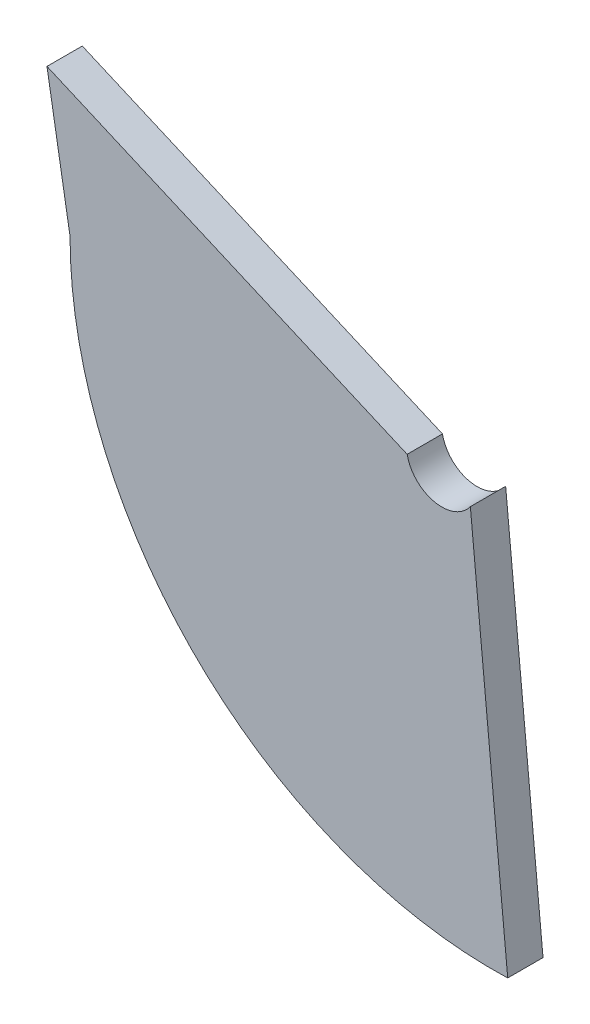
from build123d import *

# Parameters (mm, degrees)
BOSS_EXTRUDE1_DEPTH = 25.4


with BuildPart() as part:
    # Sketch2 → Boss-Extrude1 (new body)
    with BuildSketch(Plane.XY):
        with BuildLine():
            Line((-42.712105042, 344.866254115), (216.408285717, 232.755903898))
            ThreePointArc((216.408285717, 232.755903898), (235.907789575, 212.947099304), (261.875870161, 222.860634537))
            Line((261.875870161, 222.860634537), (288.747113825, -57.37639745))
            ThreePointArc((288.747113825, -57.37639745), (66.739111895, 28.198497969), (-26.126071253, 247.257105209))
            Line((-26.126071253, 247.257105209), (-42.712105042, 344.866254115))
        make_face()
    extrude(amount=BOSS_EXTRUDE1_DEPTH)


solid = part.part
